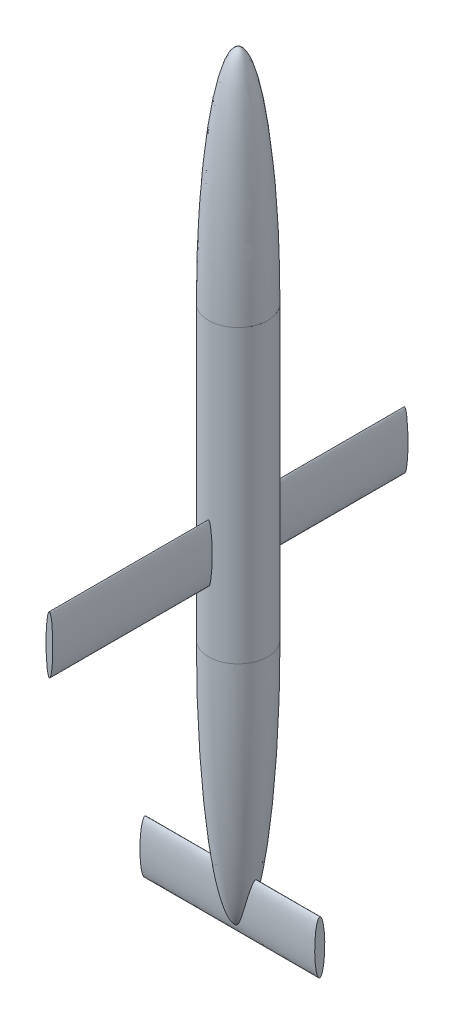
from build123d import *

# Parameters (mm, degrees)
SKETCH2_R           = 101.6
BOSS_EXTRUDE1_DEPTH = 1000
BOSS_EXTRUDE2_START = 508
SKETCH4_RX          = 98.352642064
SKETCH4_RY          = 11.693399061
BOSS_EXTRUDE2_DEPTH = 1219.2
SKETCH5_RX          = 90.619903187
SKETCH5_RY          = 17.325559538
BOSS_EXTRUDE3_DEPTH = 600


with BuildPart() as part:
    # Sketch1 → Revolve1 (revolve)
    with BuildSketch(Plane.XY, mode=Mode.PRIVATE) as revolve1_sk:
        with BuildLine():
            Line((0, 0), (101.6, 0))
            add(Edge.make_bspline(
                [(101.6, 0), (101.700823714, 761.986313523), (0.102650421, 762)],
                knots=[4.712406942, 4.712406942, 4.712406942, 6.283185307, 6.283185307, 6.283185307], degree=2, weights=[1, 0.707113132, 1]))
            Line((0.102650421, 762), (0, 0))
        make_face()
    revolve(revolve1_sk.sketch.rotate(Axis((0.102650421, 762, 0), (-0.00013471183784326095, -0.9999999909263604, 0)), 180), axis=Axis((0.102650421, 762, 0), (-0.00013471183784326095, -0.9999999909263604, 0)))


with BuildPart() as body_2:
    # Sketch2 → Boss-Extrude1 (new body)
    with BuildSketch(Plane(origin=(0, 0, 0), x_dir=(1, 0, 0), z_dir=(0, 1, 0))):
        with Locations(Location((0, 0, 0), (0, 0, 270))):
            Circle(SKETCH2_R)
    extrude(amount=-BOSS_EXTRUDE1_DEPTH)

    # Sketch3 → Revolve2 (revolve)
    with BuildSketch(Plane.XY):
        with BuildLine():
            Line((0, -1846.474744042), (0, -1000))
            Line((0, -1000), (101.6, -1000))
            add(Edge.make_bspline(
                [(0, -1846.474744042), (101.6, -1846.474744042), (101.6, -1000)],
                knots=[3.141592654, 3.141592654, 3.141592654, 4.71238898, 4.71238898, 4.71238898], degree=2, weights=[1, 0.707106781, 1]))
        make_face()
    revolve(axis=Axis((0, -1846.474744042, 0), (0, 1, 0)))

    # Sketch4 → Boss-Extrude2 (add)
    with BuildSketch(Plane.XY.offset(139.999999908).offset(BOSS_EXTRUDE2_START)):
        with Locations(Location((0, -691.236333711), (0, 0, 90))):
            Ellipse(SKETCH4_RX, SKETCH4_RY)
    extrude(amount=-BOSS_EXTRUDE2_DEPTH)

    # Sketch5 → Boss-Extrude3 (add)
    with BuildSketch(Plane(origin=(280.00000007, 0, 0), x_dir=(0, 0, -1), z_dir=(1, 0, 0))):
        with Locations(Location((0, -1774.543980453), (0, 0, -90))):
            Ellipse(SKETCH5_RX, SKETCH5_RY)
    extrude(amount=-BOSS_EXTRUDE3_DEPTH)


solid = Compound([part.part, body_2.part])
